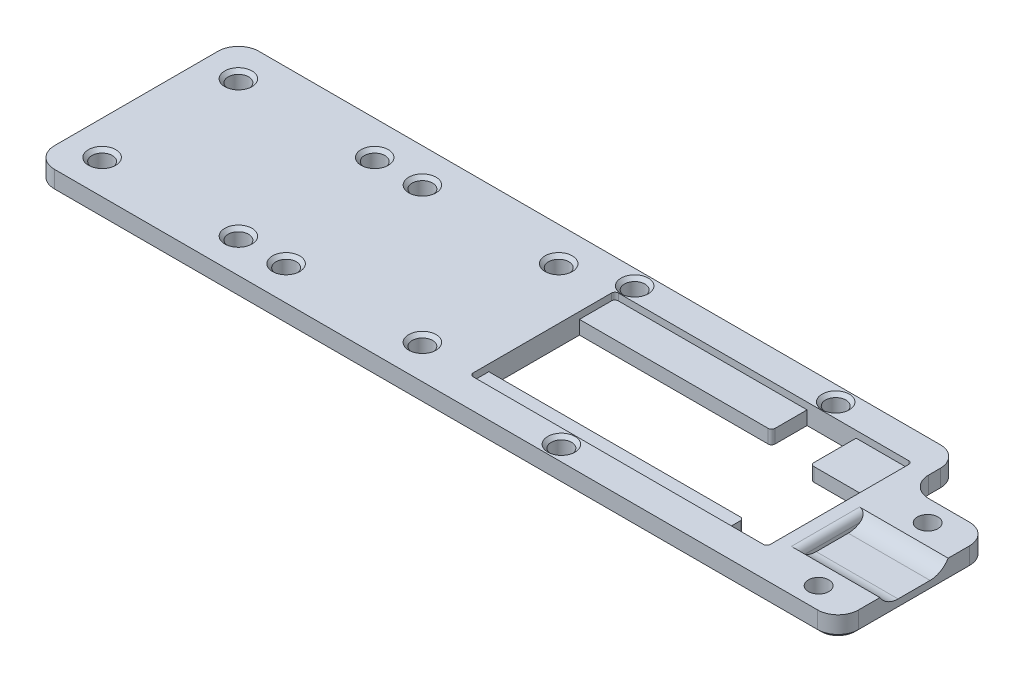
from build123d import *

# Parameters (mm, degrees)
SKETCH1_W           = 106
SKETCH1_H           = 30
BOSS_EXTRUDE1_DEPTH = 3
CUT_EXTRUDE1_DEPTH  = 1
CUT_EXTRUDE2_DEPTH  = 2
FILLET3_R           = 0.5
SKETCH5_R           = 1.5
CUT_EXTRUDE3_DEPTH  = 56.163393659
SKETCH6_R           = 1.5
CUT_EXTRUDE4_DEPTH  = 56.163393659
CHAMFER1_SIZE       = 0.5
BOSS_EXTRUDE2_DEPTH = 12
SKETCH8_W           = 12
SKETCH8_H           = 30
CUT_EXTRUDE5_DEPTH  = 12
FILLET5_R           = 1
SKETCH11_W          = 12
SKETCH11_H          = 6.597728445
BOSS_EXTRUDE4_DEPTH = 3
CUT_EXTRUDE6_START  = -12
CUT_EXTRUDE6_DEPTH  = 12
CUT_EXTRUDE7_REACH  = 121.344
SKETCH13_W          = 16.9
SKETCH13_H          = 7.7
SKETCH15_R          = 1.5
CUT_EXTRUDE8_DEPTH  = 67.775744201
FILLET6_R           = 3
CHAMFER2_SIZE       = 0.5


with BuildPart() as part:
    # Sketch1 → Boss-Extrude1 (new body)
    with BuildSketch(Plane(origin=(0, 0, 0), x_dir=(1, 0, 0), z_dir=(0, 1, 0))):
        Rectangle(SKETCH1_W, SKETCH1_H)
    extrude(amount=BOSS_EXTRUDE1_DEPTH)

    # Sketch3 → Cut-Extrude1 (cut)
    with BuildSketch(Plane(origin=(0, 3, 0), x_dir=(1, 0, 0), z_dir=(0, 1, 0))):
        with BuildLine():
            Line((6.6, 10.15), (6.6, -10.15))
            ThreePointArc((6.6, -10.15), (6.746446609, -10.503553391), (7.1, -10.65))
            Line((7.1, -10.65), (49.7, -10.65))
            ThreePointArc((49.7, -10.65), (50.053553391, -10.503553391), (50.2, -10.15))
            Line((50.2, -10.15), (50.2, 10.15))
            ThreePointArc((50.2, 10.15), (50.053553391, 10.503553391), (49.7, 10.65))
            Line((49.7, 10.65), (7.1, 10.65))
            ThreePointArc((7.1, 10.65), (6.746446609, 10.503553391), (6.6, 10.15))
        make_face()
    extrude(amount=-CUT_EXTRUDE1_DEPTH, mode=Mode.SUBTRACT)

    # Sketch4 → Cut-Extrude2 (cut)
    with BuildSketch(Plane(origin=(0, 2, 0), x_dir=(1, 0, 0), z_dir=(0, 1, 0))):
        with BuildLine():
            Line((34.8, 5.45), (34.8, 10.65))
            Line((34.8, 10.65), (42, 10.65))
            Line((42, 10.65), (42, 3.95))
            Line((42, 3.95), (50.2, 3.95))
            Line((50.2, 3.95), (50.2, -10.15))
            ThreePointArc((50.2, -10.15), (50.053553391, -10.503553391), (49.7, -10.65))
            Line((49.7, -10.65), (44, -10.65))
            Line((44, -10.65), (44, -7.85))
            Line((44, -7.85), (6.6, -7.85))
            Line((6.6, -7.85), (6.6, 5.45))
            Line((6.6, 5.45), (34.8, 5.45))
        make_face()
    extrude(amount=-CUT_EXTRUDE2_DEPTH, mode=Mode.SUBTRACT)

    # Fillet3
    fillet3_edges = [part.edges().sort_by_distance(p)[0] for p in [
        (34.8, 1, -5.45),
        (42, 1, -3.95),
        (44, 1, 7.85),
    ]]
    fillet(fillet3_edges, radius=FILLET3_R)

    # Sketch5 → Cut-Extrude3 (cut, through all)
    with BuildSketch(Plane(origin=(0, 3, 0), x_dir=(1, 0, 0), z_dir=(0, 1, 0))):
        with Locations(Location((-48, 10, 0), (0, 0, 270))):
            Circle(SKETCH5_R)
        with Locations(Location((-48, -10, 0), (0, 0, 270))):
            Circle(SKETCH5_R)
        with Locations(Location((-28, -10, 0), (0, 0, 270))):
            Circle(SKETCH5_R)
        with Locations(Location((-28, 10, 0), (0, 0, 270))):
            Circle(SKETCH5_R)
        with Locations(Location((-21, 10, 0), (0, 0, 270))):
            Circle(SKETCH5_R)
        with Locations(Location((-1, 10, 0), (0, 0, 270))):
            Circle(SKETCH5_R)
        with Locations(Location((-1, -10, 0), (0, 0, 270))):
            Circle(SKETCH5_R)
        with Locations(Location((-21, -10, 0), (0, 0, 270))):
            Circle(SKETCH5_R)
    extrude(amount=-CUT_EXTRUDE3_DEPTH, mode=Mode.SUBTRACT)

    # Sketch6 → Cut-Extrude4 (cut, through all)
    with BuildSketch(Plane(origin=(0, 3, 0), x_dir=(1, 0, 0), z_dir=(0, 1, 0))):
        with Locations(Location((7.4, 12.75, 0), (0, 0, 270))):
            Circle(SKETCH6_R)
        with Locations(Location((36.9, 12.75, 0), (0, 0, 270))):
            Circle(SKETCH6_R)
        with Locations(Location((22.15, -12.75, 0), (0, 0, 270))):
            Circle(SKETCH6_R)
    extrude(amount=-CUT_EXTRUDE4_DEPTH, mode=Mode.SUBTRACT)

    # Chamfer1
    chamfer1_edges = [part.edges().sort_by_distance(p)[0] for p in [
        (-48, 3, 8.5),
        (-28, 3, 8.5),
        (-28, 3, -11.5),
        (-21, 3, -11.5),
        (-1, 3, -11.5),
        (-1, 3, 8.5),
        (-21, 3, 8.5),
        (-48, 3, -11.5),
        (7.4, 3, -14.25),
        (36.9, 3, -14.25),
        (22.15, 3, 11.25),
    ]]
    chamfer(chamfer1_edges, length=CHAMFER1_SIZE)

    # Sketch7 → Boss-Extrude2 (add)
    with BuildSketch(Plane(origin=(53, 0, 0), x_dir=(0, 0, -1), z_dir=(1, 0, 0))):
        with BuildLine():
            Line((-6.2, 9.7), (-1.5, 9.7))
            ThreePointArc((-1.5, 9.7), (3.6, 4.6), (-1.5, -0.5))
            Line((-1.5, -0.5), (-6.2, -0.5))
            ThreePointArc((-6.2, -0.5), (-11.3, 4.6), (-6.2, 9.7))
        make_face()
        with BuildLine():
            Line((-6.2, 7.7), (-1.5, 7.7))
            ThreePointArc((-1.5, 7.7), (1.6, 4.6), (-1.5, 1.5))
            Line((-1.5, 1.5), (-6.2, 1.5))
            ThreePointArc((-6.2, 1.5), (-9.3, 4.6), (-6.2, 7.7))
        make_face(mode=Mode.SUBTRACT)
    extrude(amount=BOSS_EXTRUDE2_DEPTH)

    # Sketch8 → Cut-Extrude5 (cut)
    with BuildSketch(Plane.XZ):
        with Locations((59, 0)):
            Rectangle(SKETCH8_W, SKETCH8_H)
    extrude(amount=CUT_EXTRUDE5_DEPTH, mode=Mode.SUBTRACT)

    # Fillet5
    fillet5_edges = [part.edges().sort_by_distance(p)[0] for p in [
        (53, 3, 3.85),
    ]]
    fillet(fillet5_edges, radius=FILLET5_R)

    # Sketch11 → Boss-Extrude4 (add)
    with BuildSketch(Plane.XZ):
        with Locations((59, 11.701135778)):
            Rectangle(SKETCH11_W, SKETCH11_H)
        with Locations((59, -4.001135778)):
            Rectangle(SKETCH11_W, SKETCH11_H)
    extrude(amount=-BOSS_EXTRUDE4_DEPTH)

    # Sketch12 → Cut-Extrude6 (cut)
    with BuildSketch(Plane(origin=(65, 0, 0), x_dir=(0, 0, -1), z_dir=(1, 0, 0)).offset(CUT_EXTRUDE6_START)):
        with BuildLine():
            Line((-6.2, 7.7), (-1.5, 7.7))
            ThreePointArc((-1.5, 7.7), (1.6, 4.6), (-1.5, 1.5))
            Line((-1.5, 1.5), (-6.2, 1.5))
            ThreePointArc((-6.2, 1.5), (-9.3, 4.6), (-6.2, 7.7))
        make_face()
    extrude(amount=CUT_EXTRUDE6_DEPTH, mode=Mode.SUBTRACT)

    # Sketch13 → Cut-Extrude7 (cut, up to next)
    with BuildSketch(Plane(origin=(65, 0, 0), x_dir=(0, 0, -1), z_dir=(1, 0, 0)), mode=Mode.PRIVATE) as cut_extrude7_sk1:
        with Locations((-3.85, 6.85)):
            Rectangle(SKETCH13_W, SKETCH13_H)
    cut_extrude7_tool1 = extrude(cut_extrude7_sk1.sketch, amount=-CUT_EXTRUDE7_REACH, mode=Mode.PRIVATE) & part.part
    add(cut_extrude7_tool1.solids().sort_by_distance((65, 6.85, 3.85))[0], mode=Mode.SUBTRACT)

    # Sketch15 → Cut-Extrude8 (cut, through all)
    with BuildSketch(Plane.XZ):
        with Locations(Location((59, -4.15, 0), (0, 0, 270))):
            Circle(SKETCH15_R)
        with Locations(Location((59, 11.85, 0), (0, 0, 270))):
            Circle(SKETCH15_R)
    extrude(amount=-CUT_EXTRUDE8_DEPTH, mode=Mode.SUBTRACT)

    # Fillet6
    fillet6_edges = [part.edges().sort_by_distance(p)[0] for p in [
        (65, 1.5, 15),
        (65, 1.5, -7.3),
        (53, 1.5, -7.3),
        (-53, 1.5, -15),
        (53, 1.5, -15),
        (-53, 1.5, 15),
    ]]
    fillet(fillet6_edges, radius=FILLET6_R)

    # Chamfer2
    chamfer2_edges = [part.edges().sort_by_distance(p)[0] for p in [
        (6, 0, 15),
        (53, 0, -11.15),
        (59, 0, -7.3),
        (65, 0, 3.85),
        (-53, 0, 0),
        (0, 0, -15),
        (64.121320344, 0, -6.421320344),
        (64.121320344, 0, 14.121320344),
        (52.121320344, 0, -14.121320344),
        (-52.121320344, 0, -14.121320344),
        (-52.121320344, 0, 14.121320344),
        (53.878679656, 0, -8.178679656),
    ]]
    chamfer(chamfer2_edges, length=CHAMFER2_SIZE)


solid = part.part
